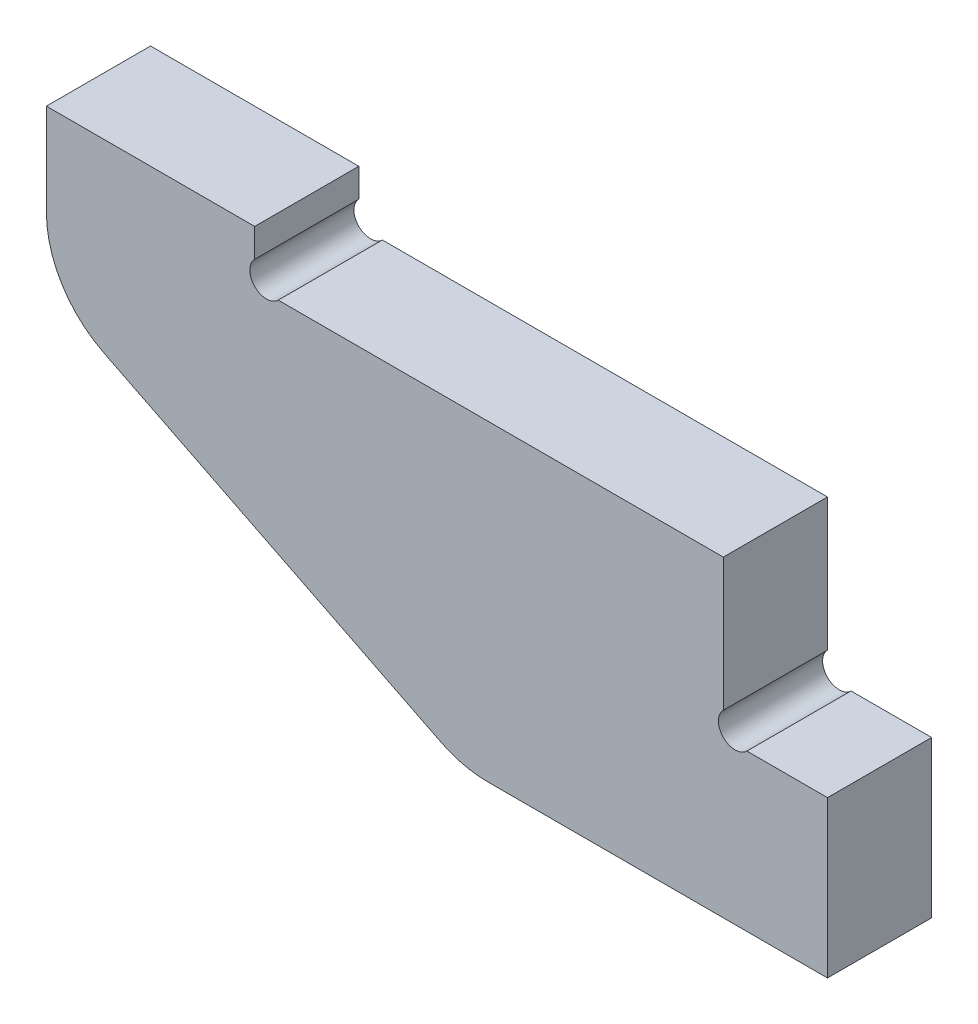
from build123d import *

# Parameters (mm, degrees)
BOSS_EXTRU_1_DEPTH = 10
CONG_1_R           = 10


with BuildPart() as part:
    # Esquisse1 → Boss.-Extru.1 (new body)
    with BuildSketch(Plane.XY):
        with BuildLine():
            Line((-52.7372583, 30), (-10, 30))
            Line((-10, 30), (-10, 17.2627417))
            ThreePointArc((-10, 17.2627417), (-10, 15), (-7.7372583, 15))
            Line((-7.7372583, 15), (0, 15))
            Line((0, 15), (0, 0))
            Line((0, 0), (-35, 0))
            Line((-35, 0), (-75, 20))
            Line((-75, 20), (-75, 35))
            Line((-75, 35), (-55, 35))
            Line((-55, 35), (-55, 32.2627417))
            ThreePointArc((-55, 32.2627417), (-55, 30), (-52.7372583, 30))
        make_face()
    extrude(amount=BOSS_EXTRU_1_DEPTH)

    # Cong_1
    cong_1_edges = [part.edges().sort_by_distance(p)[0] for p in [
        (-35, 0, 5),
        (-75, 20, 5),
    ]]
    fillet(cong_1_edges, radius=CONG_1_R)


solid = part.part
